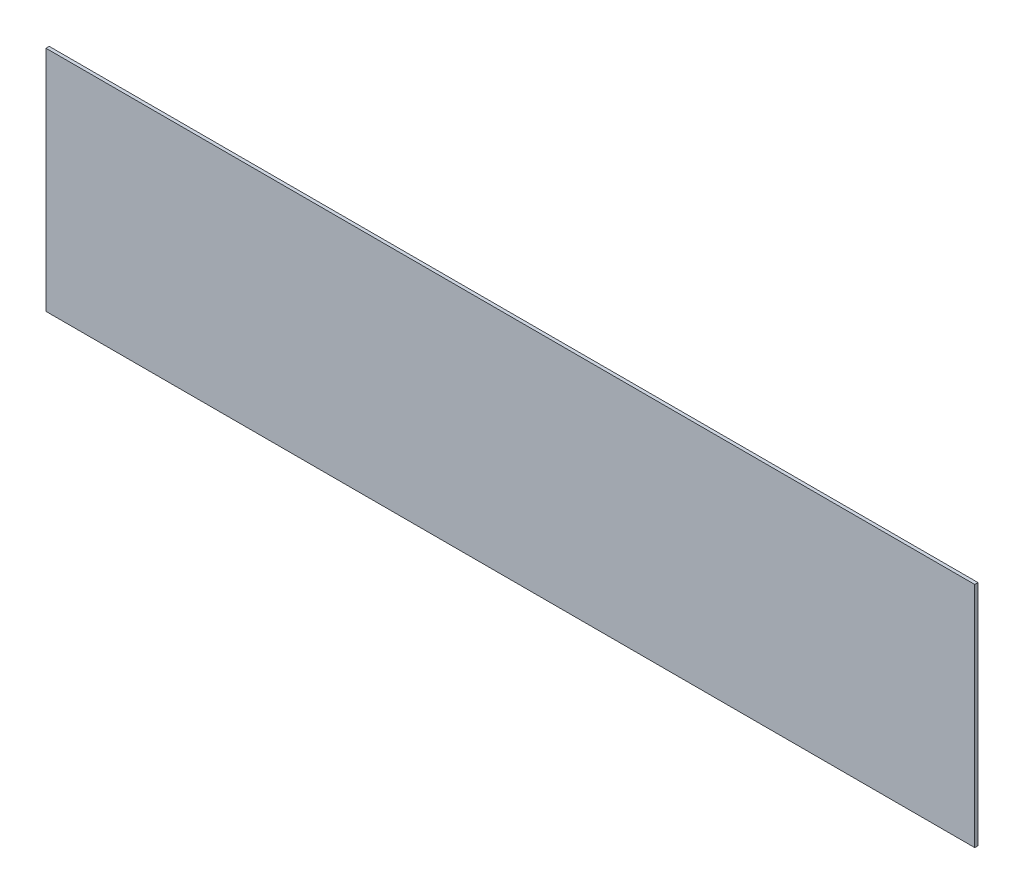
ISO-10303-21;
HEADER;
FILE_DESCRIPTION(('STEP AP214'),'2;1');
FILE_NAME('part.step','',(''),(''),'','','');
FILE_SCHEMA(('AUTOMOTIVE_DESIGN { 1 0 10303 214 1 1 1 1 }'));
ENDSEC;
DATA;
#1=APPLICATION_CONTEXT('core data for automotive mechanical design processes');
#2=APPLICATION_PROTOCOL_DEFINITION('international standard','automotive_design',2000,#1);
#3=PRODUCT_CONTEXT('',#1,'mechanical');
#4=PRODUCT('Part','Part','',(#3));
#5=PRODUCT_RELATED_PRODUCT_CATEGORY('part','',(#4));
#6=PRODUCT_DEFINITION_FORMATION('','',#4);
#7=PRODUCT_DEFINITION_CONTEXT('part definition',#1,'design');
#8=PRODUCT_DEFINITION('design','',#6,#7);
#9=PRODUCT_DEFINITION_SHAPE('','',#8);
#10=(LENGTH_UNIT() NAMED_UNIT(*) SI_UNIT(.MILLI.,.METRE.));
#11=(NAMED_UNIT(*) PLANE_ANGLE_UNIT() SI_UNIT($,.RADIAN.));
#12=(NAMED_UNIT(*) SI_UNIT($,.STERADIAN.) SOLID_ANGLE_UNIT());
#13=UNCERTAINTY_MEASURE_WITH_UNIT(LENGTH_MEASURE(1.E-05),#10,'distance_accuracy_value','');
#14=(GEOMETRIC_REPRESENTATION_CONTEXT(3) GLOBAL_UNCERTAINTY_ASSIGNED_CONTEXT((#13)) GLOBAL_UNIT_ASSIGNED_CONTEXT((#10,
#11,#12)) REPRESENTATION_CONTEXT('',''));
#15=CARTESIAN_POINT('',(0.,0.,0.));
#16=DIRECTION('',(0.,0.,1.));
#17=DIRECTION('',(1.,0.,0.));
#18=AXIS2_PLACEMENT_3D('',#15,#16,#17);
#19=CARTESIAN_POINT('',(-28.36,6.96,0.1));
#20=DIRECTION('',(1.,0.,0.));
#21=DIRECTION('',(0.,0.,-1.));
#22=AXIS2_PLACEMENT_3D('',#19,#20,#21);
#23=PLANE('',#22);
#24=DIRECTION('',(0.,-1.,0.));
#25=VECTOR('',#24,1.);
#26=CARTESIAN_POINT('',(-28.36,6.96,-0.1));
#27=LINE('',#26,#25);
#28=CARTESIAN_POINT('',(-28.36,6.96,-0.1));
#29=VERTEX_POINT('',#28);
#30=CARTESIAN_POINT('',(-28.36,-6.96,-0.1));
#31=VERTEX_POINT('',#30);
#32=EDGE_CURVE('E93',#29,#31,#27,.T.);
#33=ORIENTED_EDGE('',*,*,#32,.T.);
#34=DIRECTION('',(0.,0.,-1.));
#35=VECTOR('',#34,1.);
#36=CARTESIAN_POINT('',(-28.36,-6.96,0.1));
#37=LINE('',#36,#35);
#38=CARTESIAN_POINT('',(-28.36,-6.96,0.1));
#39=VERTEX_POINT('',#38);
#40=EDGE_CURVE('E11',#39,#31,#37,.T.);
#41=ORIENTED_EDGE('',*,*,#40,.F.);
#42=DIRECTION('',(0.,-1.,0.));
#43=VECTOR('',#42,1.);
#44=CARTESIAN_POINT('',(-28.36,6.96,0.1));
#45=LINE('',#44,#43);
#46=CARTESIAN_POINT('',(-28.36,6.96,0.1));
#47=VERTEX_POINT('',#46);
#48=EDGE_CURVE('E81',#47,#39,#45,.T.);
#49=ORIENTED_EDGE('',*,*,#48,.F.);
#50=DIRECTION('',(0.,0.,-1.));
#51=VECTOR('',#50,1.);
#52=CARTESIAN_POINT('',(-28.36,6.96,0.1));
#53=LINE('',#52,#51);
#54=EDGE_CURVE('E89',#47,#29,#53,.T.);
#55=ORIENTED_EDGE('',*,*,#54,.T.);
#56=EDGE_LOOP('',(#33,#41,#49,#55));
#57=FACE_BOUND('',#56,.T.);
#58=ADVANCED_FACE('F30',(#57),#23,.F.);
#59=CARTESIAN_POINT('',(-28.36,-6.96,0.1));
#60=DIRECTION('',(0.,1.,0.));
#61=DIRECTION('',(0.,0.,1.));
#62=AXIS2_PLACEMENT_3D('',#59,#60,#61);
#63=PLANE('',#62);
#64=DIRECTION('',(1.,0.,0.));
#65=VECTOR('',#64,1.);
#66=CARTESIAN_POINT('',(-28.36,-6.96,-0.1));
#67=LINE('',#66,#65);
#68=CARTESIAN_POINT('',(28.36,-6.96,-0.1));
#69=VERTEX_POINT('',#68);
#70=EDGE_CURVE('E85',#31,#69,#67,.T.);
#71=ORIENTED_EDGE('',*,*,#70,.T.);
#72=DIRECTION('',(0.,0.,-1.));
#73=VECTOR('',#72,1.);
#74=CARTESIAN_POINT('',(28.36,-6.96,0.1));
#75=LINE('',#74,#73);
#76=CARTESIAN_POINT('',(28.36,-6.96,0.1));
#77=VERTEX_POINT('',#76);
#78=EDGE_CURVE('E38',#77,#69,#75,.T.);
#79=ORIENTED_EDGE('',*,*,#78,.F.);
#80=DIRECTION('',(1.,0.,0.));
#81=VECTOR('',#80,1.);
#82=CARTESIAN_POINT('',(-28.36,-6.96,0.1));
#83=LINE('',#82,#81);
#84=EDGE_CURVE('E76',#39,#77,#83,.T.);
#85=ORIENTED_EDGE('',*,*,#84,.F.);
#86=ORIENTED_EDGE('',*,*,#40,.T.);
#87=EDGE_LOOP('',(#71,#79,#85,#86));
#88=FACE_BOUND('',#87,.T.);
#89=ADVANCED_FACE('F84',(#88),#63,.F.);
#90=CARTESIAN_POINT('',(28.36,6.96,0.1));
#91=DIRECTION('',(-1.,0.,0.));
#92=DIRECTION('',(0.,0.,1.));
#93=AXIS2_PLACEMENT_3D('',#90,#91,#92);
#94=PLANE('',#93);
#95=DIRECTION('',(0.,1.,0.));
#96=VECTOR('',#95,1.);
#97=CARTESIAN_POINT('',(28.36,6.96,-0.1));
#98=LINE('',#97,#96);
#99=CARTESIAN_POINT('',(28.36,6.96,-0.1));
#100=VERTEX_POINT('',#99);
#101=EDGE_CURVE('E63',#69,#100,#98,.T.);
#102=ORIENTED_EDGE('',*,*,#101,.T.);
#103=DIRECTION('',(0.,0.,-1.));
#104=VECTOR('',#103,1.);
#105=CARTESIAN_POINT('',(28.36,6.96,0.1));
#106=LINE('',#105,#104);
#107=CARTESIAN_POINT('',(28.36,6.96,0.1));
#108=VERTEX_POINT('',#107);
#109=EDGE_CURVE('E86',#108,#100,#106,.T.);
#110=ORIENTED_EDGE('',*,*,#109,.F.);
#111=DIRECTION('',(0.,1.,0.));
#112=VECTOR('',#111,1.);
#113=CARTESIAN_POINT('',(28.36,6.96,0.1));
#114=LINE('',#113,#112);
#115=EDGE_CURVE('E79',#77,#108,#114,.T.);
#116=ORIENTED_EDGE('',*,*,#115,.F.);
#117=ORIENTED_EDGE('',*,*,#78,.T.);
#118=EDGE_LOOP('',(#102,#110,#116,#117));
#119=FACE_BOUND('',#118,.T.);
#120=ADVANCED_FACE('F87',(#119),#94,.F.);
#121=CARTESIAN_POINT('',(-28.36,6.96,0.1));
#122=DIRECTION('',(0.,-1.,0.));
#123=DIRECTION('',(0.,0.,-1.));
#124=AXIS2_PLACEMENT_3D('',#121,#122,#123);
#125=PLANE('',#124);
#126=DIRECTION('',(-1.,0.,0.));
#127=VECTOR('',#126,1.);
#128=CARTESIAN_POINT('',(-28.36,6.96,-0.1));
#129=LINE('',#128,#127);
#130=EDGE_CURVE('E69',#100,#29,#129,.T.);
#131=ORIENTED_EDGE('',*,*,#130,.T.);
#132=ORIENTED_EDGE('',*,*,#54,.F.);
#133=DIRECTION('',(-1.,0.,0.));
#134=VECTOR('',#133,1.);
#135=CARTESIAN_POINT('',(-28.36,6.96,0.1));
#136=LINE('',#135,#134);
#137=EDGE_CURVE('E46',#108,#47,#136,.T.);
#138=ORIENTED_EDGE('',*,*,#137,.F.);
#139=ORIENTED_EDGE('',*,*,#109,.T.);
#140=EDGE_LOOP('',(#131,#132,#138,#139));
#141=FACE_BOUND('',#140,.T.);
#142=ADVANCED_FACE('F100',(#141),#125,.F.);
#143=CARTESIAN_POINT('',(-28.36,-6.96,0.1));
#144=DIRECTION('',(0.,0.,1.));
#145=DIRECTION('',(1.,0.,0.));
#146=AXIS2_PLACEMENT_3D('',#143,#144,#145);
#147=PLANE('',#146);
#148=ORIENTED_EDGE('',*,*,#48,.T.);
#149=ORIENTED_EDGE('',*,*,#84,.T.);
#150=ORIENTED_EDGE('',*,*,#115,.T.);
#151=ORIENTED_EDGE('',*,*,#137,.T.);
#152=EDGE_LOOP('',(#148,#149,#150,#151));
#153=FACE_BOUND('',#152,.T.);
#154=ADVANCED_FACE('F77',(#153),#147,.T.);
#155=CARTESIAN_POINT('',(-28.36,-6.96,-0.1));
#156=DIRECTION('',(0.,0.,1.));
#157=DIRECTION('',(1.,0.,0.));
#158=AXIS2_PLACEMENT_3D('',#155,#156,#157);
#159=PLANE('',#158);
#160=ORIENTED_EDGE('',*,*,#32,.F.);
#161=ORIENTED_EDGE('',*,*,#130,.F.);
#162=ORIENTED_EDGE('',*,*,#101,.F.);
#163=ORIENTED_EDGE('',*,*,#70,.F.);
#164=EDGE_LOOP('',(#160,#161,#162,#163));
#165=FACE_BOUND('',#164,.T.);
#166=ADVANCED_FACE('F103',(#165),#159,.F.);
#167=CLOSED_SHELL('',(#58,#89,#120,#142,#154,#166));
#168=MANIFOLD_SOLID_BREP('B2',#167);
#169=ADVANCED_BREP_SHAPE_REPRESENTATION('',(#18,#168),#14);
#170=SHAPE_DEFINITION_REPRESENTATION(#9,#169);
ENDSEC;
END-ISO-10303-21;
